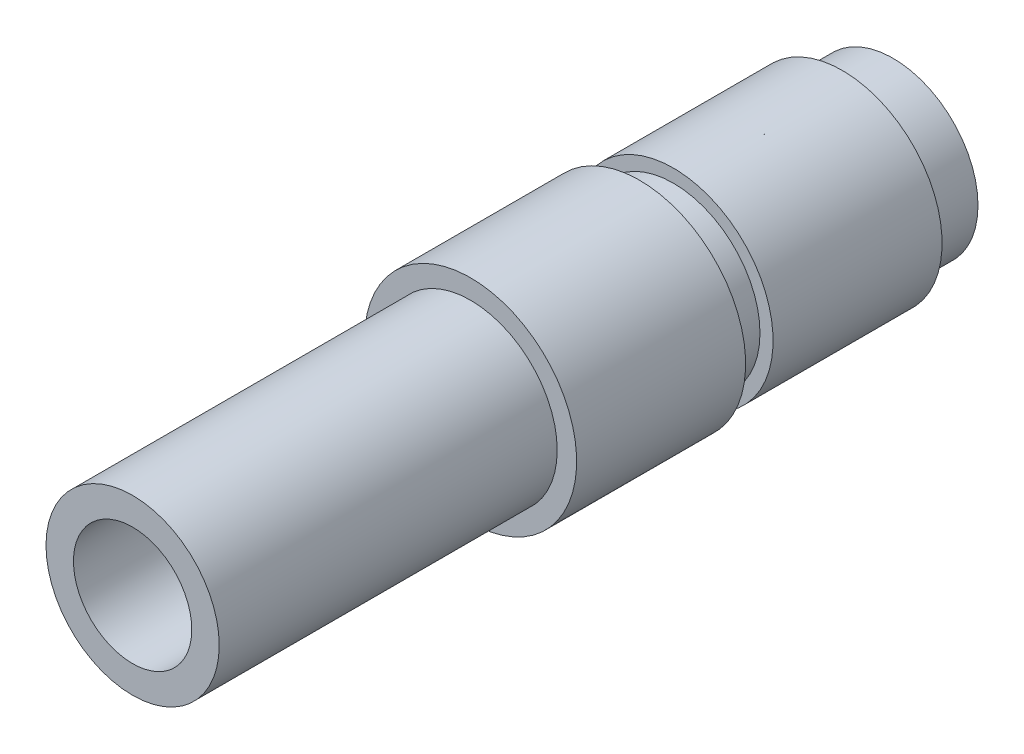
ISO-10303-21;
HEADER;
FILE_DESCRIPTION(('STEP AP214'),'2;1');
FILE_NAME('part.step','',(''),(''),'','','');
FILE_SCHEMA(('AUTOMOTIVE_DESIGN { 1 0 10303 214 1 1 1 1 }'));
ENDSEC;
DATA;
#1=APPLICATION_CONTEXT('core data for automotive mechanical design processes');
#2=APPLICATION_PROTOCOL_DEFINITION('international standard','automotive_design',2000,#1);
#3=PRODUCT_CONTEXT('',#1,'mechanical');
#4=PRODUCT('Part','Part','',(#3));
#5=PRODUCT_RELATED_PRODUCT_CATEGORY('part','',(#4));
#6=PRODUCT_DEFINITION_FORMATION('','',#4);
#7=PRODUCT_DEFINITION_CONTEXT('part definition',#1,'design');
#8=PRODUCT_DEFINITION('design','',#6,#7);
#9=PRODUCT_DEFINITION_SHAPE('','',#8);
#10=(LENGTH_UNIT() NAMED_UNIT(*) SI_UNIT(.MILLI.,.METRE.));
#11=(NAMED_UNIT(*) PLANE_ANGLE_UNIT() SI_UNIT($,.RADIAN.));
#12=(NAMED_UNIT(*) SI_UNIT($,.STERADIAN.) SOLID_ANGLE_UNIT());
#13=UNCERTAINTY_MEASURE_WITH_UNIT(LENGTH_MEASURE(1.E-05),#10,'distance_accuracy_value','');
#14=(GEOMETRIC_REPRESENTATION_CONTEXT(3) GLOBAL_UNCERTAINTY_ASSIGNED_CONTEXT((#13)) GLOBAL_UNIT_ASSIGNED_CONTEXT((#10,
#11,#12)) REPRESENTATION_CONTEXT('',''));
#15=CARTESIAN_POINT('',(0.,0.,0.));
#16=DIRECTION('',(0.,0.,1.));
#17=DIRECTION('',(1.,0.,0.));
#18=AXIS2_PLACEMENT_3D('',#15,#16,#17);
#19=CARTESIAN_POINT('',(0.,0.,-22.3012));
#20=DIRECTION('',(0.,0.,-1.));
#21=DIRECTION('',(-1.,0.,0.));
#22=AXIS2_PLACEMENT_3D('',#19,#20,#21);
#23=CONICAL_SURFACE('',#22,2.1209,0.5235987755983);
#24=CARTESIAN_POINT('',(0.,0.,-21.7072797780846));
#25=DIRECTION('',(0.,0.,-1.));
#26=DIRECTION('',(-1.,0.,0.));
#27=AXIS2_PLACEMENT_3D('',#24,#25,#26);
#28=CIRCLE('',#27,1.778);
#29=CARTESIAN_POINT('',(-1.778,0.,-21.7072797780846));
#30=VERTEX_POINT('',#29);
#31=EDGE_CURVE('E55',#30,#30,#28,.T.);
#32=ORIENTED_EDGE('',*,*,#31,.F.);
#33=EDGE_LOOP('',(#32));
#34=FACE_BOUND('',#33,.T.);
#35=CARTESIAN_POINT('',(0.,0.,-21.7575096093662));
#36=DIRECTION('',(0.,0.,-1.));
#37=DIRECTION('',(-1.,0.,0.));
#38=AXIS2_PLACEMENT_3D('',#35,#36,#37);
#39=CIRCLE('',#38,1.80700020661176);
#40=CARTESIAN_POINT('',(0.,1.80700020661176,-21.7575096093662));
#41=VERTEX_POINT('',#40);
#42=EDGE_CURVE('E34',#41,#41,#39,.F.);
#43=ORIENTED_EDGE('',*,*,#42,.F.);
#44=EDGE_LOOP('',(#43));
#45=FACE_BOUND('',#44,.T.);
#46=ADVANCED_FACE('F30',(#34,#45),#23,.F.);
#47=CARTESIAN_POINT('',(0.,0.,-22.3012));
#48=DIRECTION('',(0.,0.,-1.));
#49=DIRECTION('',(-1.,0.,0.));
#50=AXIS2_PLACEMENT_3D('',#47,#48,#49);
#51=CIRCLE('',#50,2.1209);
#52=CARTESIAN_POINT('',(-2.1209,0.,-22.3012));
#53=VERTEX_POINT('',#52);
#54=EDGE_CURVE('E51',#53,#53,#51,.T.);
#55=ORIENTED_EDGE('',*,*,#54,.T.);
#56=EDGE_LOOP('',(#55));
#57=FACE_BOUND('',#56,.T.);
#58=CARTESIAN_POINT('',(0.,0.,-22.0749371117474));
#59=DIRECTION('',(0.,0.,1.));
#60=DIRECTION('',(1.,0.,0.));
#61=AXIS2_PLACEMENT_3D('',#58,#59,#60);
#62=CIRCLE('',#61,1.99026706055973);
#63=CARTESIAN_POINT('',(0.,1.99026706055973,-22.0749371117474));
#64=VERTEX_POINT('',#63);
#65=EDGE_CURVE('E46',#64,#64,#62,.F.);
#66=ORIENTED_EDGE('',*,*,#65,.F.);
#67=EDGE_LOOP('',(#66));
#68=FACE_BOUND('',#67,.T.);
#69=ADVANCED_FACE('F111',(#57,#68),#23,.F.);
#70=CARTESIAN_POINT('',(0.,0.,-22.86));
#71=DIRECTION('',(0.,0.,1.));
#72=DIRECTION('',(1.,0.,0.));
#73=AXIS2_PLACEMENT_3D('',#70,#71,#72);
#74=CYLINDRICAL_SURFACE('',#73,1.778);
#75=ORIENTED_EDGE('',*,*,#31,.T.);
#76=EDGE_LOOP('',(#75));
#77=FACE_BOUND('',#76,.T.);
#78=CARTESIAN_POINT('',(0.,0.,0.));
#79=DIRECTION('',(0.,0.,1.));
#80=DIRECTION('',(1.,0.,0.));
#81=AXIS2_PLACEMENT_3D('',#78,#79,#80);
#82=CIRCLE('',#81,1.778);
#83=CARTESIAN_POINT('',(1.778,0.,0.));
#84=VERTEX_POINT('',#83);
#85=EDGE_CURVE('E65',#84,#84,#82,.T.);
#86=ORIENTED_EDGE('',*,*,#85,.T.);
#87=EDGE_LOOP('',(#86));
#88=FACE_BOUND('',#87,.T.);
#89=ADVANCED_FACE('F117',(#77,#88),#74,.F.);
#90=CARTESIAN_POINT('',(0.,0.,-21.336));
#91=DIRECTION('',(0.,0.,-1.));
#92=DIRECTION('',(-1.,0.,0.));
#93=AXIS2_PLACEMENT_3D('',#90,#91,#92);
#94=PLANE('',#93);
#95=CARTESIAN_POINT('',(0.,0.,-21.336));
#96=DIRECTION('',(0.,0.,-1.));
#97=DIRECTION('',(-1.,0.,0.));
#98=AXIS2_PLACEMENT_3D('',#95,#96,#97);
#99=CIRCLE('',#98,2.9972);
#100=CARTESIAN_POINT('',(-2.9972,0.,-21.336));
#101=VERTEX_POINT('',#100);
#102=EDGE_CURVE('E75',#101,#101,#99,.T.);
#103=ORIENTED_EDGE('',*,*,#102,.T.);
#104=EDGE_LOOP('',(#103));
#105=FACE_BOUND('',#104,.T.);
#106=CARTESIAN_POINT('',(0.,0.,-21.336));
#107=DIRECTION('',(0.,0.,-1.));
#108=DIRECTION('',(-1.,0.,0.));
#109=AXIS2_PLACEMENT_3D('',#106,#107,#108);
#110=CIRCLE('',#109,2.5527);
#111=CARTESIAN_POINT('',(2.5527,0.,-21.336));
#112=VERTEX_POINT('',#111);
#113=EDGE_CURVE('E68',#112,#112,#110,.T.);
#114=ORIENTED_EDGE('',*,*,#113,.F.);
#115=EDGE_LOOP('',(#114));
#116=FACE_BOUND('',#115,.T.);
#117=ADVANCED_FACE('F130',(#105,#116),#94,.T.);
#118=CARTESIAN_POINT('',(0.,0.,-15.24));
#119=DIRECTION('',(0.,0.,-1.));
#120=DIRECTION('',(-1.,0.,0.));
#121=AXIS2_PLACEMENT_3D('',#118,#119,#120);
#122=PLANE('',#121);
#123=CARTESIAN_POINT('',(0.,0.,-15.24));
#124=DIRECTION('',(0.,0.,-1.));
#125=DIRECTION('',(-1.,0.,0.));
#126=AXIS2_PLACEMENT_3D('',#123,#124,#125);
#127=CIRCLE('',#126,3.1877);
#128=CARTESIAN_POINT('',(-3.1877,0.,-15.24));
#129=VERTEX_POINT('',#128);
#130=EDGE_CURVE('E43',#129,#129,#127,.T.);
#131=ORIENTED_EDGE('',*,*,#130,.T.);
#132=EDGE_LOOP('',(#131));
#133=FACE_BOUND('',#132,.T.);
#134=CARTESIAN_POINT('',(0.,0.,-15.24));
#135=DIRECTION('',(0.,0.,-1.));
#136=DIRECTION('',(-1.,0.,0.));
#137=AXIS2_PLACEMENT_3D('',#134,#135,#136);
#138=CIRCLE('',#137,2.6035);
#139=CARTESIAN_POINT('',(-2.6035,0.,-15.24));
#140=VERTEX_POINT('',#139);
#141=EDGE_CURVE('E78',#140,#140,#138,.T.);
#142=ORIENTED_EDGE('',*,*,#141,.F.);
#143=EDGE_LOOP('',(#142));
#144=FACE_BOUND('',#143,.T.);
#145=ADVANCED_FACE('F142',(#133,#144),#122,.T.);
#146=CARTESIAN_POINT('',(0.,0.,-10.16));
#147=DIRECTION('',(0.,0.,1.));
#148=DIRECTION('',(1.,0.,0.));
#149=AXIS2_PLACEMENT_3D('',#146,#147,#148);
#150=CYLINDRICAL_SURFACE('',#149,2.6035);
#151=CARTESIAN_POINT('',(0.,0.,-10.16));
#152=DIRECTION('',(0.,0.,-1.));
#153=DIRECTION('',(-1.,0.,0.));
#154=AXIS2_PLACEMENT_3D('',#151,#152,#153);
#155=CIRCLE('',#154,2.6035);
#156=CARTESIAN_POINT('',(-2.6035,0.,-10.16));
#157=VERTEX_POINT('',#156);
#158=EDGE_CURVE('E38',#157,#157,#155,.F.);
#159=ORIENTED_EDGE('',*,*,#158,.T.);
#160=EDGE_LOOP('',(#159));
#161=FACE_BOUND('',#160,.T.);
#162=CARTESIAN_POINT('',(0.,0.,0.));
#163=DIRECTION('',(0.,0.,1.));
#164=DIRECTION('',(1.,0.,0.));
#165=AXIS2_PLACEMENT_3D('',#162,#163,#164);
#166=CIRCLE('',#165,2.6035);
#167=CARTESIAN_POINT('',(2.6035,0.,0.));
#168=VERTEX_POINT('',#167);
#169=EDGE_CURVE('E10',#168,#168,#166,.T.);
#170=ORIENTED_EDGE('',*,*,#169,.F.);
#171=EDGE_LOOP('',(#170));
#172=FACE_BOUND('',#171,.T.);
#173=ADVANCED_FACE('F32',(#161,#172),#150,.T.);
#174=CARTESIAN_POINT('',(0.,0.,0.));
#175=DIRECTION('',(0.,0.,1.));
#176=DIRECTION('',(1.,0.,0.));
#177=AXIS2_PLACEMENT_3D('',#174,#175,#176);
#178=PLANE('',#177);
#179=ORIENTED_EDGE('',*,*,#85,.F.);
#180=EDGE_LOOP('',(#179));
#181=FACE_BOUND('',#180,.T.);
#182=ORIENTED_EDGE('',*,*,#169,.T.);
#183=EDGE_LOOP('',(#182));
#184=FACE_BOUND('',#183,.T.);
#185=ADVANCED_FACE('F105',(#181,#184),#178,.T.);
#186=CARTESIAN_POINT('',(0.,0.,-15.24));
#187=DIRECTION('',(0.,0.,1.));
#188=DIRECTION('',(1.,0.,0.));
#189=AXIS2_PLACEMENT_3D('',#186,#187,#188);
#190=CYLINDRICAL_SURFACE('',#189,3.1877);
#191=ORIENTED_EDGE('',*,*,#130,.F.);
#192=EDGE_LOOP('',(#191));
#193=FACE_BOUND('',#192,.T.);
#194=CARTESIAN_POINT('',(0.,0.,-10.16));
#195=DIRECTION('',(0.,0.,-1.));
#196=DIRECTION('',(-1.,0.,0.));
#197=AXIS2_PLACEMENT_3D('',#194,#195,#196);
#198=CIRCLE('',#197,3.1877);
#199=CARTESIAN_POINT('',(-3.1877,0.,-10.16));
#200=VERTEX_POINT('',#199);
#201=EDGE_CURVE('E84',#200,#200,#198,.T.);
#202=ORIENTED_EDGE('',*,*,#201,.T.);
#203=EDGE_LOOP('',(#202));
#204=FACE_BOUND('',#203,.T.);
#205=ADVANCED_FACE('F91',(#193,#204),#190,.T.);
#206=CARTESIAN_POINT('',(0.,0.,-10.16));
#207=DIRECTION('',(0.,0.,-1.));
#208=DIRECTION('',(-1.,0.,0.));
#209=AXIS2_PLACEMENT_3D('',#206,#207,#208);
#210=PLANE('',#209);
#211=ORIENTED_EDGE('',*,*,#158,.F.);
#212=EDGE_LOOP('',(#211));
#213=FACE_BOUND('',#212,.T.);
#214=ORIENTED_EDGE('',*,*,#201,.F.);
#215=EDGE_LOOP('',(#214));
#216=FACE_BOUND('',#215,.T.);
#217=ADVANCED_FACE('F93',(#213,#216),#210,.F.);
#218=CARTESIAN_POINT('',(0.,0.,-16.256));
#219=DIRECTION('',(0.,0.,1.));
#220=DIRECTION('',(1.,0.,0.));
#221=AXIS2_PLACEMENT_3D('',#218,#219,#220);
#222=CYLINDRICAL_SURFACE('',#221,2.6035);
#223=CARTESIAN_POINT('',(0.,0.,-16.256));
#224=DIRECTION('',(0.,0.,-1.));
#225=DIRECTION('',(-1.,0.,0.));
#226=AXIS2_PLACEMENT_3D('',#223,#224,#225);
#227=CIRCLE('',#226,2.6035);
#228=CARTESIAN_POINT('',(-2.6035,0.,-16.256));
#229=VERTEX_POINT('',#228);
#230=EDGE_CURVE('E81',#229,#229,#227,.T.);
#231=ORIENTED_EDGE('',*,*,#230,.F.);
#232=EDGE_LOOP('',(#231));
#233=FACE_BOUND('',#232,.T.);
#234=ORIENTED_EDGE('',*,*,#141,.T.);
#235=EDGE_LOOP('',(#234));
#236=FACE_BOUND('',#235,.T.);
#237=ADVANCED_FACE('F95',(#233,#236),#222,.T.);
#238=CARTESIAN_POINT('',(0.,0.,-16.256));
#239=DIRECTION('',(0.,0.,-1.));
#240=DIRECTION('',(-1.,0.,0.));
#241=AXIS2_PLACEMENT_3D('',#238,#239,#240);
#242=PLANE('',#241);
#243=CARTESIAN_POINT('',(0.,0.,-16.256));
#244=DIRECTION('',(0.,0.,-1.));
#245=DIRECTION('',(-1.,0.,0.));
#246=AXIS2_PLACEMENT_3D('',#243,#244,#245);
#247=CIRCLE('',#246,2.9972);
#248=CARTESIAN_POINT('',(-2.9972,0.,-16.256));
#249=VERTEX_POINT('',#248);
#250=EDGE_CURVE('E72',#249,#249,#247,.T.);
#251=ORIENTED_EDGE('',*,*,#250,.F.);
#252=EDGE_LOOP('',(#251));
#253=FACE_BOUND('',#252,.T.);
#254=ORIENTED_EDGE('',*,*,#230,.T.);
#255=EDGE_LOOP('',(#254));
#256=FACE_BOUND('',#255,.T.);
#257=ADVANCED_FACE('F102',(#253,#256),#242,.F.);
#258=CARTESIAN_POINT('',(0.,0.,-21.336));
#259=DIRECTION('',(0.,0.,1.));
#260=DIRECTION('',(1.,0.,0.));
#261=AXIS2_PLACEMENT_3D('',#258,#259,#260);
#262=CYLINDRICAL_SURFACE('',#261,2.9972);
#263=ORIENTED_EDGE('',*,*,#102,.F.);
#264=EDGE_LOOP('',(#263));
#265=FACE_BOUND('',#264,.T.);
#266=ORIENTED_EDGE('',*,*,#250,.T.);
#267=EDGE_LOOP('',(#266));
#268=FACE_BOUND('',#267,.T.);
#269=ADVANCED_FACE('F138',(#265,#268),#262,.T.);
#270=CARTESIAN_POINT('',(0.,0.,-22.86));
#271=DIRECTION('',(0.,0.,1.));
#272=DIRECTION('',(1.,0.,0.));
#273=AXIS2_PLACEMENT_3D('',#270,#271,#272);
#274=CYLINDRICAL_SURFACE('',#273,2.5527);
#275=CARTESIAN_POINT('',(0.,0.,-22.86));
#276=DIRECTION('',(0.,0.,-1.));
#277=DIRECTION('',(-1.,0.,0.));
#278=AXIS2_PLACEMENT_3D('',#275,#276,#277);
#279=CIRCLE('',#278,2.5527);
#280=CARTESIAN_POINT('',(2.5527,0.,-22.86));
#281=VERTEX_POINT('',#280);
#282=EDGE_CURVE('E69',#281,#281,#279,.T.);
#283=CARTESIAN_POINT('',(2.5527,0.,-22.86));
#284=CARTESIAN_POINT('',(2.5527,0.,-22.844125));
#285=CARTESIAN_POINT('',(2.5527,0.,-22.82825));
#286=CARTESIAN_POINT('',(2.5527,0.,-22.7965));
#287=CARTESIAN_POINT('',(2.5527,0.,-22.780625));
#288=CARTESIAN_POINT('',(2.5527,0.,-22.748875));
#289=CARTESIAN_POINT('',(2.5527,0.,-22.733));
#290=CARTESIAN_POINT('',(2.5527,0.,-22.70125));
#291=CARTESIAN_POINT('',(2.5527,0.,-22.685375));
#292=CARTESIAN_POINT('',(2.5527,0.,-22.653625));
#293=CARTESIAN_POINT('',(2.5527,0.,-22.63775));
#294=CARTESIAN_POINT('',(2.5527,0.,-22.606));
#295=CARTESIAN_POINT('',(2.5527,0.,-22.590125));
#296=CARTESIAN_POINT('',(2.5527,0.,-22.558375));
#297=CARTESIAN_POINT('',(2.5527,0.,-22.5425));
#298=CARTESIAN_POINT('',(2.5527,0.,-22.51075));
#299=CARTESIAN_POINT('',(2.5527,0.,-22.494875));
#300=CARTESIAN_POINT('',(2.5527,0.,-22.463125));
#301=CARTESIAN_POINT('',(2.5527,0.,-22.44725));
#302=CARTESIAN_POINT('',(2.5527,0.,-22.4155));
#303=CARTESIAN_POINT('',(2.5527,0.,-22.399625));
#304=CARTESIAN_POINT('',(2.5527,0.,-22.367875));
#305=CARTESIAN_POINT('',(2.5527,0.,-22.352));
#306=CARTESIAN_POINT('',(2.5527,0.,-22.32025));
#307=CARTESIAN_POINT('',(2.5527,0.,-22.304375));
#308=CARTESIAN_POINT('',(2.5527,0.,-22.272625));
#309=CARTESIAN_POINT('',(2.5527,0.,-22.25675));
#310=CARTESIAN_POINT('',(2.5527,0.,-22.225));
#311=CARTESIAN_POINT('',(2.5527,0.,-22.209125));
#312=CARTESIAN_POINT('',(2.5527,0.,-22.177375));
#313=CARTESIAN_POINT('',(2.5527,0.,-22.1615));
#314=CARTESIAN_POINT('',(2.5527,0.,-22.12975));
#315=CARTESIAN_POINT('',(2.5527,0.,-22.113875));
#316=CARTESIAN_POINT('',(2.5527,0.,-22.082125));
#317=CARTESIAN_POINT('',(2.5527,0.,-22.06625));
#318=CARTESIAN_POINT('',(2.5527,0.,-22.0345));
#319=CARTESIAN_POINT('',(2.5527,0.,-22.018625));
#320=CARTESIAN_POINT('',(2.5527,0.,-21.986875));
#321=CARTESIAN_POINT('',(2.5527,0.,-21.971));
#322=CARTESIAN_POINT('',(2.5527,0.,-21.93925));
#323=CARTESIAN_POINT('',(2.5527,0.,-21.923375));
#324=CARTESIAN_POINT('',(2.5527,0.,-21.891625));
#325=CARTESIAN_POINT('',(2.5527,0.,-21.87575));
#326=CARTESIAN_POINT('',(2.5527,0.,-21.844));
#327=CARTESIAN_POINT('',(2.5527,0.,-21.828125));
#328=CARTESIAN_POINT('',(2.5527,0.,-21.796375));
#329=CARTESIAN_POINT('',(2.5527,0.,-21.7805));
#330=CARTESIAN_POINT('',(2.5527,0.,-21.74875));
#331=CARTESIAN_POINT('',(2.5527,0.,-21.732875));
#332=CARTESIAN_POINT('',(2.5527,0.,-21.701125));
#333=CARTESIAN_POINT('',(2.5527,0.,-21.68525));
#334=CARTESIAN_POINT('',(2.5527,0.,-21.6535));
#335=CARTESIAN_POINT('',(2.5527,0.,-21.637625));
#336=CARTESIAN_POINT('',(2.5527,0.,-21.605875));
#337=CARTESIAN_POINT('',(2.5527,0.,-21.59));
#338=CARTESIAN_POINT('',(2.5527,0.,-21.55825));
#339=CARTESIAN_POINT('',(2.5527,0.,-21.542375));
#340=CARTESIAN_POINT('',(2.5527,0.,-21.510625));
#341=CARTESIAN_POINT('',(2.5527,0.,-21.49475));
#342=CARTESIAN_POINT('',(2.5527,0.,-21.463));
#343=CARTESIAN_POINT('',(2.5527,0.,-21.447125));
#344=CARTESIAN_POINT('',(2.5527,0.,-21.415375));
#345=CARTESIAN_POINT('',(2.5527,0.,-21.3995));
#346=CARTESIAN_POINT('',(2.5527,0.,-21.36775));
#347=CARTESIAN_POINT('',(2.5527,0.,-21.351875));
#348=CARTESIAN_POINT('',(2.5527,0.,-21.336));
#349=B_SPLINE_CURVE_WITH_KNOTS('',3,(#283,#284,#285,#286,#287,#288,#289,#290,#291,#292,#293,
#294,#295,#296,#297,#298,#299,#300,#301,#302,#303,#304,#305,#306,#307,#308,#309,#310,#311,#312,
#313,#314,#315,#316,#317,#318,#319,#320,#321,#322,#323,#324,#325,#326,#327,#328,#329,#330,#331,
#332,#333,#334,#335,#336,#337,#338,#339,#340,#341,#342,#343,#344,#345,#346,#347,#348),
.UNSPECIFIED.,.F.,.F.,(4,2,2,2,2,2,2,2,2,2,2,2,2,2,2,2,2,2,2,2,2,2,2,2,2,2,2,2,2,2,2,2,4),(0.,
0.0476249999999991,0.0952499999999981,0.142874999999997,0.1905,0.238124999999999,
0.285749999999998,0.333374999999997,0.380999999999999,0.428624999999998,0.476249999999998,
0.523875,0.571499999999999,0.619124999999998,0.666749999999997,0.714375,0.761999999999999,
0.809624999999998,0.85725,0.904874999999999,0.952499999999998,1.000125,1.04775,1.095375,1.143,
1.190625,1.23825,1.285875,1.3335,1.381125,1.42875,1.476375,1.524),.UNSPECIFIED.);
#350=EDGE_CURVE('BSEAM134',#281,#112,#349,.T.);
#351=ORIENTED_EDGE('',*,*,#282,.F.);
#352=ORIENTED_EDGE('',*,*,#113,.T.);
#353=ORIENTED_EDGE('',*,*,#350,.T.);
#354=ORIENTED_EDGE('',*,*,#350,.F.);
#355=EDGE_LOOP('',(#351,#353,#352,#354));
#356=FACE_BOUND('',#355,.T.);
#357=ADVANCED_FACE('F134',(#356),#274,.T.);
#358=CARTESIAN_POINT('',(0.,0.,-22.86));
#359=DIRECTION('',(0.,0.,-1.));
#360=DIRECTION('',(-1.,0.,0.));
#361=AXIS2_PLACEMENT_3D('',#358,#359,#360);
#362=PLANE('',#361);
#363=CARTESIAN_POINT('',(0.,0.,-22.86));
#364=DIRECTION('',(0.,0.,-1.));
#365=DIRECTION('',(-1.,0.,0.));
#366=AXIS2_PLACEMENT_3D('',#363,#364,#365);
#367=CIRCLE('',#366,2.1209);
#368=CARTESIAN_POINT('',(-2.1209,0.,-22.86));
#369=VERTEX_POINT('',#368);
#370=EDGE_CURVE('E60',#369,#369,#367,.T.);
#371=ORIENTED_EDGE('',*,*,#370,.F.);
#372=EDGE_LOOP('',(#371));
#373=FACE_BOUND('',#372,.T.);
#374=ORIENTED_EDGE('',*,*,#282,.T.);
#375=EDGE_LOOP('',(#374));
#376=FACE_BOUND('',#375,.T.);
#377=ADVANCED_FACE('F126',(#373,#376),#362,.T.);
#378=CARTESIAN_POINT('',(0.,0.,-22.3012));
#379=DIRECTION('',(0.,0.,-1.));
#380=DIRECTION('',(-1.,0.,0.));
#381=AXIS2_PLACEMENT_3D('',#378,#379,#380);
#382=CYLINDRICAL_SURFACE('',#381,2.1209);
#383=ORIENTED_EDGE('',*,*,#370,.T.);
#384=EDGE_LOOP('',(#383));
#385=FACE_BOUND('',#384,.T.);
#386=ORIENTED_EDGE('',*,*,#54,.F.);
#387=EDGE_LOOP('',(#386));
#388=FACE_BOUND('',#387,.T.);
#389=ADVANCED_FACE('F123',(#385,#388),#382,.F.);
#390=CARTESIAN_POINT('',(0.,0.,-23.0124));
#391=DIRECTION('',(0.,0.,1.));
#392=DIRECTION('',(0.,1.,0.));
#393=AXIS2_PLACEMENT_3D('',#390,#391,#392);
#394=SPHERICAL_SURFACE('',#393,2.199999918);
#395=CARTESIAN_POINT('',(0.,1.99026706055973,-22.0749371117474));
#396=CARTESIAN_POINT('',(0.,1.98863822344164,-22.0714790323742));
#397=CARTESIAN_POINT('',(0.,1.9870003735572,-22.0680251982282));
#398=CARTESIAN_POINT('',(0.,1.98370669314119,-22.0611261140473));
#399=CARTESIAN_POINT('',(0.,1.98205086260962,-22.0576808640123));
#400=CARTESIAN_POINT('',(0.,1.97872126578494,-22.0507990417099));
#401=CARTESIAN_POINT('',(0.,1.97704749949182,-22.0473624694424));
#402=CARTESIAN_POINT('',(0.,1.97368207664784,-22.0404980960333));
#403=CARTESIAN_POINT('',(0.,1.97199042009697,-22.0370702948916));
#404=CARTESIAN_POINT('',(0.,1.96858926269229,-22.0302235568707));
#405=CARTESIAN_POINT('',(0.,1.96687976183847,-22.0268046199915));
#406=CARTESIAN_POINT('',(0.,1.96344296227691,-22.0199757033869));
#407=CARTESIAN_POINT('',(0.,1.96171566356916,-22.0165657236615));
#408=CARTESIAN_POINT('',(0.,1.95824331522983,-22.0097548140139));
#409=CARTESIAN_POINT('',(0.,1.95649826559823,-22.0063538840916));
#410=CARTESIAN_POINT('',(0.,1.95299046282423,-21.999561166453));
#411=CARTESIAN_POINT('',(0.,1.95122770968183,-21.9961693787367));
#412=CARTESIAN_POINT('',(0.,1.94768454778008,-21.989395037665));
#413=CARTESIAN_POINT('',(0.,1.94590413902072,-21.9860124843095));
#414=CARTESIAN_POINT('',(0.,1.94232571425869,-21.979256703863));
#415=CARTESIAN_POINT('',(0.,1.94052769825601,-21.9758834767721));
#416=CARTESIAN_POINT('',(0.,1.9369141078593,-21.969146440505));
#417=CARTESIAN_POINT('',(0.,1.93509853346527,-21.965782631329));
#418=CARTESIAN_POINT('',(0.,1.93144987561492,-21.9590645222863));
#419=CARTESIAN_POINT('',(0.,1.9296167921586,-21.9557102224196));
#420=CARTESIAN_POINT('',(0.,1.92593316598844,-21.9490112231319));
#421=CARTESIAN_POINT('',(0.,1.92408262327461,-21.9456665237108));
#422=CARTESIAN_POINT('',(0.,1.92036412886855,-21.9389868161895));
#423=CARTESIAN_POINT('',(0.,1.91849617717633,-21.9356518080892));
#424=CARTESIAN_POINT('',(0.,1.91474291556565,-21.9289915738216));
#425=CARTESIAN_POINT('',(0.,1.91285760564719,-21.9256663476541));
#426=CARTESIAN_POINT('',(0.,1.9090696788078,-21.9190257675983));
#427=CARTESIAN_POINT('',(0.,1.90716706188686,-21.9157104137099));
#428=CARTESIAN_POINT('',(0.,1.9033445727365,-21.9090896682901));
#429=CARTESIAN_POINT('',(0.,1.90142470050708,-21.9057842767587));
#430=CARTESIAN_POINT('',(0.,1.89756775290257,-21.8991835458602));
#431=CARTESIAN_POINT('',(0.,1.89563067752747,-21.8958882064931));
#432=CARTESIAN_POINT('',(0.,1.89173937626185,-21.8893076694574));
#433=CARTESIAN_POINT('',(0.,1.88978515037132,-21.8860224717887));
#434=CARTESIAN_POINT('',(0.,1.88585960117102,-21.8794623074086));
#435=CARTESIAN_POINT('',(0.,1.88388827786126,-21.8761873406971));
#436=CARTESIAN_POINT('',(0.,1.87992858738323,-21.8696477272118));
#437=CARTESIAN_POINT('',(0.,1.87794022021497,-21.866383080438));
#438=CARTESIAN_POINT('',(0.,1.87394649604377,-21.8598641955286));
#439=CARTESIAN_POINT('',(0.,1.87194113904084,-21.8566099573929));
#440=CARTESIAN_POINT('',(0.,1.86791348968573,-21.8501119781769));
#441=CARTESIAN_POINT('',(0.,1.86589119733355,-21.8468682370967));
#442=CARTESIAN_POINT('',(0.,1.86182973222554,-21.840391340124));
#443=CARTESIAN_POINT('',(0.,1.85979055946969,-21.8371581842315));
#444=CARTESIAN_POINT('',(0.,1.85569538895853,-21.830702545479));
#445=CARTESIAN_POINT('',(0.,1.85363939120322,-21.827480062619));
#446=CARTESIAN_POINT('',(0.,1.84951062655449,-21.821045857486));
#447=CARTESIAN_POINT('',(0.,1.84743785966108,-21.817834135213));
#448=CARTESIAN_POINT('',(0.,1.84327561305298,-21.8114215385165));
#449=CARTESIAN_POINT('',(0.,1.8411861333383,-21.808220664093));
#450=CARTESIAN_POINT('',(0.,1.83699051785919,-21.8018298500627));
#451=CARTESIAN_POINT('',(0.,1.83488438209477,-21.7986399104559));
#452=CARTESIAN_POINT('',(0.,1.83065551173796,-21.7922710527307));
#453=CARTESIAN_POINT('',(0.,1.82853277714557,-21.7890921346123));
#454=CARTESIAN_POINT('',(0.,1.82427076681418,-21.7827454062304));
#455=CARTESIAN_POINT('',(0.,1.82213149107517,-21.7795775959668));
#456=CARTESIAN_POINT('',(0.,1.81783645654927,-21.773253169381));
#457=CARTESIAN_POINT('',(0.,1.81568069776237,-21.7700965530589));
#458=CARTESIAN_POINT('',(0.,1.81135275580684,-21.7637946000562));
#459=CARTESIAN_POINT('',(0.,1.8091805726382,-21.7606492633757));
#460=CARTESIAN_POINT('',(0.,1.80700020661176,-21.7575096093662));
#461=B_SPLINE_CURVE_WITH_KNOTS('',3,(#395,#396,#397,#398,#399,#400,#401,#402,#403,#404,#405,
#406,#407,#408,#409,#410,#411,#412,#413,#414,#415,#416,#417,#418,#419,#420,#421,#422,#423,#424,
#425,#426,#427,#428,#429,#430,#431,#432,#433,#434,#435,#436,#437,#438,#439,#440,#441,#442,#443,
#444,#445,#446,#447,#448,#449,#450,#451,#452,#453,#454,#455,#456,#457,#458,#459,#460),
.UNSPECIFIED.,.F.,.F.,(4,2,2,2,2,2,2,2,2,2,2,2,2,2,2,2,2,2,2,2,2,2,2,2,2,2,2,2,2,2,2,2,4),(0.,
0.0114674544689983,0.0229349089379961,0.0344023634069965,0.0458698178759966,0.0573372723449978,
0.0688047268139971,0.0802721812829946,0.0917396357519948,0.103207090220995,0.114674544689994,
0.126141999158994,0.137609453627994,0.149076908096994,0.160544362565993,0.172011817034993,
0.183479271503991,0.194946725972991,0.20641418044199,0.21788163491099,0.229349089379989,
0.24081654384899,0.252283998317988,0.263751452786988,0.275218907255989,0.286686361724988,
0.298153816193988,0.309621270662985,0.321088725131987,0.332556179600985,0.344023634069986,
0.355491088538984,0.366958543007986),.UNSPECIFIED.);
#462=EDGE_CURVE('BSEAM122',#64,#41,#461,.T.);
#463=ORIENTED_EDGE('',*,*,#65,.T.);
#464=ORIENTED_EDGE('',*,*,#42,.T.);
#465=ORIENTED_EDGE('',*,*,#462,.T.);
#466=ORIENTED_EDGE('',*,*,#462,.F.);
#467=EDGE_LOOP('',(#463,#465,#464,#466));
#468=FACE_BOUND('',#467,.T.);
#469=ADVANCED_FACE('F122',(#468),#394,.F.);
#470=CLOSED_SHELL('',(#46,#69,#89,#117,#145,#173,#185,#205,#217,#237,#257,#269,#357,#377,#389,#469));
#471=MANIFOLD_SOLID_BREP('B2',#470);
#472=ADVANCED_BREP_SHAPE_REPRESENTATION('',(#18,#471),#14);
#473=SHAPE_DEFINITION_REPRESENTATION(#9,#472);
ENDSEC;
END-ISO-10303-21;
